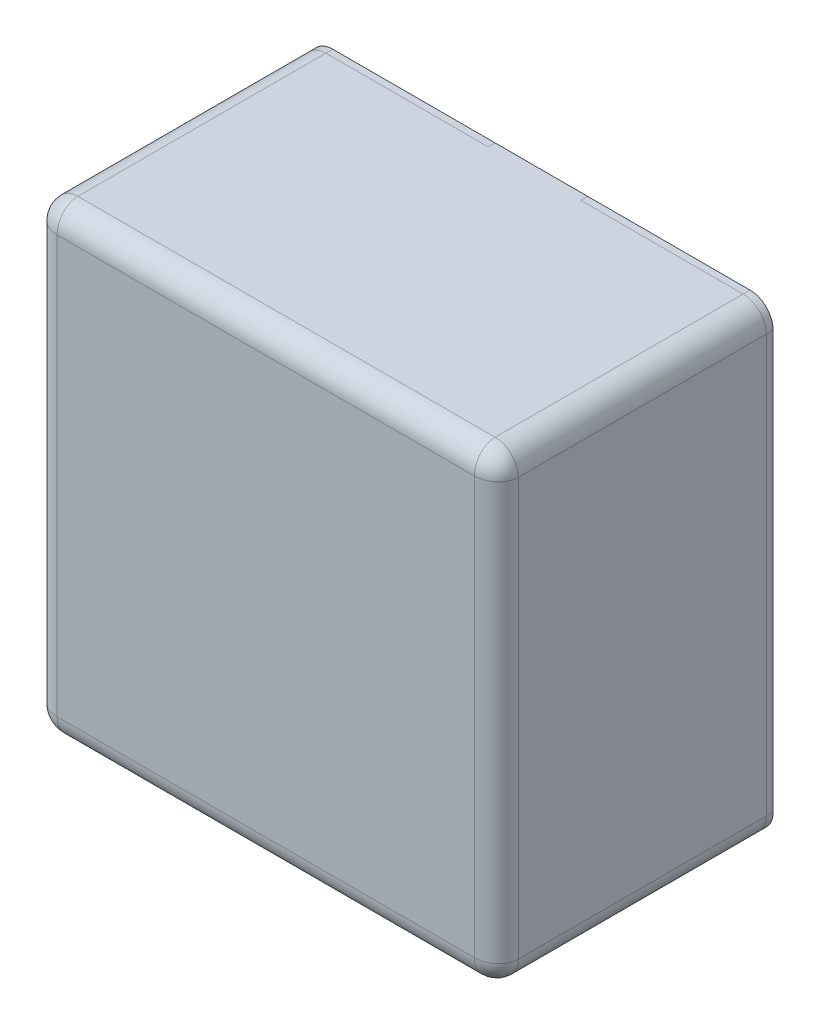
ISO-10303-21;
HEADER;
FILE_DESCRIPTION(('STEP AP214'),'2;1');
FILE_NAME('part.step','',(''),(''),'','','');
FILE_SCHEMA(('AUTOMOTIVE_DESIGN { 1 0 10303 214 1 1 1 1 }'));
ENDSEC;
DATA;
#1=APPLICATION_CONTEXT('core data for automotive mechanical design processes');
#2=APPLICATION_PROTOCOL_DEFINITION('international standard','automotive_design',2000,#1);
#3=PRODUCT_CONTEXT('',#1,'mechanical');
#4=PRODUCT('Part','Part','',(#3));
#5=PRODUCT_RELATED_PRODUCT_CATEGORY('part','',(#4));
#6=PRODUCT_DEFINITION_FORMATION('','',#4);
#7=PRODUCT_DEFINITION_CONTEXT('part definition',#1,'design');
#8=PRODUCT_DEFINITION('design','',#6,#7);
#9=PRODUCT_DEFINITION_SHAPE('','',#8);
#10=(LENGTH_UNIT() NAMED_UNIT(*) SI_UNIT(.MILLI.,.METRE.));
#11=(NAMED_UNIT(*) PLANE_ANGLE_UNIT() SI_UNIT($,.RADIAN.));
#12=(NAMED_UNIT(*) SI_UNIT($,.STERADIAN.) SOLID_ANGLE_UNIT());
#13=UNCERTAINTY_MEASURE_WITH_UNIT(LENGTH_MEASURE(1.E-05),#10,'distance_accuracy_value','');
#14=(GEOMETRIC_REPRESENTATION_CONTEXT(3) GLOBAL_UNCERTAINTY_ASSIGNED_CONTEXT((#13)) GLOBAL_UNIT_ASSIGNED_CONTEXT((#10,
#11,#12)) REPRESENTATION_CONTEXT('',''));
#15=CARTESIAN_POINT('',(0.,0.,0.));
#16=DIRECTION('',(0.,0.,1.));
#17=DIRECTION('',(1.,0.,0.));
#18=AXIS2_PLACEMENT_3D('',#15,#16,#17);
#19=CARTESIAN_POINT('',(3.03,2.96999999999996,2.04));
#20=DIRECTION('',(0.,0.,1.));
#21=DIRECTION('',(1.,0.,0.));
#22=AXIS2_PLACEMENT_3D('',#19,#20,#21);
#23=CYLINDRICAL_SURFACE('',#22,0.33);
#24=CARTESIAN_POINT('',(3.03,2.96999999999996,2.04));
#25=DIRECTION('',(0.,0.,1.));
#26=DIRECTION('',(0.,-1.,0.));
#27=AXIS2_PLACEMENT_3D('',#24,#25,#26);
#28=CIRCLE('',#27,0.33);
#29=CARTESIAN_POINT('',(3.36,2.96999999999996,2.04));
#30=VERTEX_POINT('',#29);
#31=CARTESIAN_POINT('',(3.03,3.29999999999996,2.04));
#32=VERTEX_POINT('',#31);
#33=EDGE_CURVE('E11',#30,#32,#28,.T.);
#34=ORIENTED_EDGE('',*,*,#33,.T.);
#35=DIRECTION('',(0.,0.,1.));
#36=VECTOR('',#35,1.);
#37=CARTESIAN_POINT('',(3.03,3.29999999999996,2.04));
#38=LINE('',#37,#36);
#39=CARTESIAN_POINT('',(3.03,3.29999999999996,2.13806148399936));
#40=VERTEX_POINT('',#39);
#41=EDGE_CURVE('E374',#32,#40,#38,.T.);
#42=ORIENTED_EDGE('',*,*,#41,.T.);
#43=CARTESIAN_POINT('',(3.03,2.96999999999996,2.13806148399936));
#44=DIRECTION('',(0.,0.,1.));
#45=DIRECTION('',(0.,-1.,0.));
#46=AXIS2_PLACEMENT_3D('',#43,#44,#45);
#47=CIRCLE('',#46,0.33);
#48=CARTESIAN_POINT('',(3.36,2.96999999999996,2.13806148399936));
#49=VERTEX_POINT('',#48);
#50=EDGE_CURVE('E367',#49,#40,#47,.T.);
#51=ORIENTED_EDGE('',*,*,#50,.F.);
#52=DIRECTION('',(0.,0.,1.));
#53=VECTOR('',#52,1.);
#54=CARTESIAN_POINT('',(3.36,2.96999999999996,2.04));
#55=LINE('',#54,#53);
#56=EDGE_CURVE('E275',#30,#49,#55,.T.);
#57=ORIENTED_EDGE('',*,*,#56,.F.);
#58=EDGE_LOOP('',(#34,#42,#51,#57));
#59=FACE_BOUND('',#58,.T.);
#60=ADVANCED_FACE('F17',(#59),#23,.T.);
#61=CARTESIAN_POINT('',(0.720000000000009,-3.30000000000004,2.04));
#62=DIRECTION('',(0.,0.,1.));
#63=DIRECTION('',(1.,0.,0.));
#64=AXIS2_PLACEMENT_3D('',#61,#62,#63);
#65=PLANE('',#64);
#66=DIRECTION('',(1.,0.,0.));
#67=VECTOR('',#66,1.);
#68=CARTESIAN_POINT('',(0.720000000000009,3.29999999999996,2.04));
#69=LINE('',#68,#67);
#70=CARTESIAN_POINT('',(0.720000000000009,3.29999999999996,2.04));
#71=VERTEX_POINT('',#70);
#72=EDGE_CURVE('E371',#71,#32,#69,.T.);
#73=ORIENTED_EDGE('',*,*,#72,.T.);
#74=ORIENTED_EDGE('',*,*,#33,.F.);
#75=DIRECTION('',(0.,1.,0.));
#76=VECTOR('',#75,1.);
#77=CARTESIAN_POINT('',(3.36,-3.30000000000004,2.04));
#78=LINE('',#77,#76);
#79=CARTESIAN_POINT('',(3.36,-2.97000000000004,2.04));
#80=VERTEX_POINT('',#79);
#81=EDGE_CURVE('E278',#80,#30,#78,.T.);
#82=ORIENTED_EDGE('',*,*,#81,.F.);
#83=CARTESIAN_POINT('',(3.03,-2.97000000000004,2.04));
#84=DIRECTION('',(0.,0.,-1.));
#85=DIRECTION('',(0.,-1.,0.));
#86=AXIS2_PLACEMENT_3D('',#83,#84,#85);
#87=CIRCLE('',#86,0.33);
#88=CARTESIAN_POINT('',(3.03,-3.30000000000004,2.04));
#89=VERTEX_POINT('',#88);
#90=EDGE_CURVE('E28',#80,#89,#87,.T.);
#91=ORIENTED_EDGE('',*,*,#90,.T.);
#92=DIRECTION('',(1.,0.,0.));
#93=VECTOR('',#92,1.);
#94=CARTESIAN_POINT('',(0.720000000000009,-3.30000000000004,2.04));
#95=LINE('',#94,#93);
#96=CARTESIAN_POINT('',(0.720000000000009,-3.30000000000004,2.04));
#97=VERTEX_POINT('',#96);
#98=EDGE_CURVE('E363',#97,#89,#95,.T.);
#99=ORIENTED_EDGE('',*,*,#98,.F.);
#100=DIRECTION('',(0.,1.,0.));
#101=VECTOR('',#100,1.);
#102=CARTESIAN_POINT('',(0.720000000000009,-3.30000000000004,2.04));
#103=LINE('',#102,#101);
#104=EDGE_CURVE('E302',#97,#71,#103,.T.);
#105=ORIENTED_EDGE('',*,*,#104,.T.);
#106=EDGE_LOOP('',(#73,#74,#82,#91,#99,#105));
#107=FACE_BOUND('',#106,.T.);
#108=ADVANCED_FACE('F382',(#107),#65,.F.);
#109=CARTESIAN_POINT('',(3.03,-2.97000000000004,2.04));
#110=DIRECTION('',(0.,0.,1.));
#111=DIRECTION('',(1.,0.,0.));
#112=AXIS2_PLACEMENT_3D('',#109,#110,#111);
#113=CYLINDRICAL_SURFACE('',#112,0.33);
#114=DIRECTION('',(0.,0.,1.));
#115=VECTOR('',#114,1.);
#116=CARTESIAN_POINT('',(3.36,-2.97000000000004,2.04));
#117=LINE('',#116,#115);
#118=CARTESIAN_POINT('',(3.36,-2.97000000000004,2.13806148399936));
#119=VERTEX_POINT('',#118);
#120=EDGE_CURVE('E377',#80,#119,#117,.T.);
#121=ORIENTED_EDGE('',*,*,#120,.T.);
#122=CARTESIAN_POINT('',(3.03,-2.97000000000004,2.13806148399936));
#123=DIRECTION('',(0.,0.,-1.));
#124=DIRECTION('',(0.,-1.,0.));
#125=AXIS2_PLACEMENT_3D('',#122,#123,#124);
#126=CIRCLE('',#125,0.33);
#127=CARTESIAN_POINT('',(3.03,-3.30000000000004,2.13806148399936));
#128=VERTEX_POINT('',#127);
#129=EDGE_CURVE('E286',#119,#128,#126,.T.);
#130=ORIENTED_EDGE('',*,*,#129,.T.);
#131=DIRECTION('',(0.,0.,1.));
#132=VECTOR('',#131,1.);
#133=CARTESIAN_POINT('',(3.03,-3.30000000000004,2.04));
#134=LINE('',#133,#132);
#135=EDGE_CURVE('E364',#89,#128,#134,.T.);
#136=ORIENTED_EDGE('',*,*,#135,.F.);
#137=ORIENTED_EDGE('',*,*,#90,.F.);
#138=EDGE_LOOP('',(#121,#130,#136,#137));
#139=FACE_BOUND('',#138,.T.);
#140=ADVANCED_FACE('F387',(#139),#113,.T.);
#141=CARTESIAN_POINT('',(3.36,-3.30000000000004,2.04));
#142=DIRECTION('',(1.,0.,0.));
#143=DIRECTION('',(0.,1.,0.));
#144=AXIS2_PLACEMENT_3D('',#141,#142,#143);
#145=PLANE('',#144);
#146=DIRECTION('',(0.,1.,0.));
#147=VECTOR('',#146,1.);
#148=CARTESIAN_POINT('',(3.36,-3.30000000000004,2.13806148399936));
#149=LINE('',#148,#147);
#150=EDGE_CURVE('E345',#119,#49,#149,.T.);
#151=ORIENTED_EDGE('',*,*,#150,.F.);
#152=ORIENTED_EDGE('',*,*,#120,.F.);
#153=ORIENTED_EDGE('',*,*,#81,.T.);
#154=ORIENTED_EDGE('',*,*,#56,.T.);
#155=EDGE_LOOP('',(#151,#152,#153,#154));
#156=FACE_BOUND('',#155,.T.);
#157=ADVANCED_FACE('F469',(#156),#145,.T.);
#158=CARTESIAN_POINT('',(0.720000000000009,3.29999999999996,2.04));
#159=DIRECTION('',(0.,1.,0.));
#160=DIRECTION('',(1.,0.,0.));
#161=AXIS2_PLACEMENT_3D('',#158,#159,#160);
#162=PLANE('',#161);
#163=ORIENTED_EDGE('',*,*,#72,.F.);
#164=DIRECTION('',(0.,0.,1.));
#165=VECTOR('',#164,1.);
#166=CARTESIAN_POINT('',(0.720000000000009,3.29999999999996,2.04));
#167=LINE('',#166,#165);
#168=CARTESIAN_POINT('',(0.720000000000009,3.29999999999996,2.13806148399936));
#169=VERTEX_POINT('',#168);
#170=EDGE_CURVE('E331',#71,#169,#167,.T.);
#171=ORIENTED_EDGE('',*,*,#170,.T.);
#172=DIRECTION('',(1.,0.,0.));
#173=VECTOR('',#172,1.);
#174=CARTESIAN_POINT('',(0.720000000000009,3.29999999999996,2.13806148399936));
#175=LINE('',#174,#173);
#176=EDGE_CURVE('E327',#169,#40,#175,.T.);
#177=ORIENTED_EDGE('',*,*,#176,.T.);
#178=ORIENTED_EDGE('',*,*,#41,.F.);
#179=EDGE_LOOP('',(#163,#171,#177,#178));
#180=FACE_BOUND('',#179,.T.);
#181=ADVANCED_FACE('F456',(#180),#162,.T.);
#182=CARTESIAN_POINT('',(3.03,2.96999999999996,2.04));
#183=DIRECTION('',(0.,0.,1.));
#184=DIRECTION('',(1.,0.,0.));
#185=AXIS2_PLACEMENT_3D('',#182,#183,#184);
#186=CYLINDRICAL_SURFACE('',#185,0.33);
#187=DIRECTION('',(0.,0.,1.));
#188=VECTOR('',#187,1.);
#189=CARTESIAN_POINT('',(3.36,2.96999999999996,2.04));
#190=LINE('',#189,#188);
#191=CARTESIAN_POINT('',(3.36,2.96999999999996,5.66827490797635));
#192=VERTEX_POINT('',#191);
#193=EDGE_CURVE('E349',#49,#192,#190,.T.);
#194=ORIENTED_EDGE('',*,*,#193,.F.);
#195=ORIENTED_EDGE('',*,*,#50,.T.);
#196=DIRECTION('',(0.,0.,1.));
#197=VECTOR('',#196,1.);
#198=CARTESIAN_POINT('',(3.03,3.29999999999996,2.04));
#199=LINE('',#198,#197);
#200=CARTESIAN_POINT('',(3.03,3.29999999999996,5.66827490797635));
#201=VERTEX_POINT('',#200);
#202=EDGE_CURVE('E323',#40,#201,#199,.T.);
#203=ORIENTED_EDGE('',*,*,#202,.T.);
#204=CARTESIAN_POINT('',(3.03,2.96999999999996,5.66827490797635));
#205=DIRECTION('',(0.,0.,-1.));
#206=DIRECTION('',(0.,1.,0.));
#207=AXIS2_PLACEMENT_3D('',#204,#205,#206);
#208=CIRCLE('',#207,0.33);
#209=EDGE_CURVE('E338',#201,#192,#208,.T.);
#210=ORIENTED_EDGE('',*,*,#209,.T.);
#211=EDGE_LOOP('',(#194,#195,#203,#210));
#212=FACE_BOUND('',#211,.T.);
#213=ADVANCED_FACE('F463',(#212),#186,.T.);
#214=CARTESIAN_POINT('',(-3.24,3.29999999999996,2.04));
#215=DIRECTION('',(0.,1.,0.));
#216=DIRECTION('',(1.,0.,0.));
#217=AXIS2_PLACEMENT_3D('',#214,#215,#216);
#218=PLANE('',#217);
#219=DIRECTION('',(1.,0.,0.));
#220=VECTOR('',#219,1.);
#221=CARTESIAN_POINT('',(-3.24,3.29999999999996,2.04));
#222=LINE('',#221,#220);
#223=CARTESIAN_POINT('',(-2.91,3.29999999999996,2.04));
#224=VERTEX_POINT('',#223);
#225=CARTESIAN_POINT('',(-0.599999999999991,3.29999999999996,2.04));
#226=VERTEX_POINT('',#225);
#227=EDGE_CURVE('E312',#224,#226,#222,.T.);
#228=ORIENTED_EDGE('',*,*,#227,.F.);
#229=DIRECTION('',(0.,0.,1.));
#230=VECTOR('',#229,1.);
#231=CARTESIAN_POINT('',(-2.91,3.29999999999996,2.04));
#232=LINE('',#231,#230);
#233=CARTESIAN_POINT('',(-2.91,3.29999999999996,2.13806148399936));
#234=VERTEX_POINT('',#233);
#235=EDGE_CURVE('E346',#224,#234,#232,.T.);
#236=ORIENTED_EDGE('',*,*,#235,.T.);
#237=DIRECTION('',(1.,0.,0.));
#238=VECTOR('',#237,1.);
#239=CARTESIAN_POINT('',(-3.24,3.29999999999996,2.13806148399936));
#240=LINE('',#239,#238);
#241=CARTESIAN_POINT('',(-0.599999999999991,3.29999999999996,2.13806148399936));
#242=VERTEX_POINT('',#241);
#243=EDGE_CURVE('E319',#234,#242,#240,.T.);
#244=ORIENTED_EDGE('',*,*,#243,.T.);
#245=DIRECTION('',(0.,0.,1.));
#246=VECTOR('',#245,1.);
#247=CARTESIAN_POINT('',(-0.599999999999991,3.29999999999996,2.04));
#248=LINE('',#247,#246);
#249=EDGE_CURVE('E335',#226,#242,#248,.T.);
#250=ORIENTED_EDGE('',*,*,#249,.F.);
#251=EDGE_LOOP('',(#228,#236,#244,#250));
#252=FACE_BOUND('',#251,.T.);
#253=ADVANCED_FACE('F662',(#252),#218,.T.);
#254=CARTESIAN_POINT('',(0.720000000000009,-3.30000000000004,2.04));
#255=DIRECTION('',(0.,1.,0.));
#256=DIRECTION('',(1.,0.,0.));
#257=AXIS2_PLACEMENT_3D('',#254,#255,#256);
#258=PLANE('',#257);
#259=ORIENTED_EDGE('',*,*,#98,.T.);
#260=ORIENTED_EDGE('',*,*,#135,.T.);
#261=DIRECTION('',(1.,0.,0.));
#262=VECTOR('',#261,1.);
#263=CARTESIAN_POINT('',(0.720000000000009,-3.30000000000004,2.13806148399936));
#264=LINE('',#263,#262);
#265=CARTESIAN_POINT('',(0.720000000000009,-3.30000000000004,2.13806148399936));
#266=VERTEX_POINT('',#265);
#267=EDGE_CURVE('E298',#266,#128,#264,.T.);
#268=ORIENTED_EDGE('',*,*,#267,.F.);
#269=DIRECTION('',(0.,0.,1.));
#270=VECTOR('',#269,1.);
#271=CARTESIAN_POINT('',(0.720000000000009,-3.30000000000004,2.04));
#272=LINE('',#271,#270);
#273=EDGE_CURVE('E294',#97,#266,#272,.T.);
#274=ORIENTED_EDGE('',*,*,#273,.F.);
#275=EDGE_LOOP('',(#259,#260,#268,#274));
#276=FACE_BOUND('',#275,.T.);
#277=ADVANCED_FACE('F392',(#276),#258,.F.);
#278=CARTESIAN_POINT('',(-3.24,-3.30000000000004,2.04));
#279=DIRECTION('',(0.,0.,1.));
#280=DIRECTION('',(1.,0.,0.));
#281=AXIS2_PLACEMENT_3D('',#278,#279,#280);
#282=PLANE('',#281);
#283=DIRECTION('',(0.,1.,0.));
#284=VECTOR('',#283,1.);
#285=CARTESIAN_POINT('',(-0.599999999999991,-3.30000000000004,2.04));
#286=LINE('',#285,#284);
#287=CARTESIAN_POINT('',(-0.599999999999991,-3.30000000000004,2.04));
#288=VERTEX_POINT('',#287);
#289=EDGE_CURVE('E287',#288,#226,#286,.T.);
#290=ORIENTED_EDGE('',*,*,#289,.T.);
#291=DIRECTION('',(1.,0.,0.));
#292=VECTOR('',#291,1.);
#293=CARTESIAN_POINT('',(-3.24,3.29999999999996,2.04));
#294=LINE('',#293,#292);
#295=EDGE_CURVE('E334',#226,#71,#294,.T.);
#296=ORIENTED_EDGE('',*,*,#295,.T.);
#297=ORIENTED_EDGE('',*,*,#104,.F.);
#298=DIRECTION('',(1.,0.,0.));
#299=VECTOR('',#298,1.);
#300=CARTESIAN_POINT('',(-3.24,-3.30000000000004,2.04));
#301=LINE('',#300,#299);
#302=EDGE_CURVE('E292',#288,#97,#301,.T.);
#303=ORIENTED_EDGE('',*,*,#302,.F.);
#304=EDGE_LOOP('',(#290,#296,#297,#303));
#305=FACE_BOUND('',#304,.T.);
#306=ADVANCED_FACE('F450',(#305),#282,.F.);
#307=CARTESIAN_POINT('',(-3.24,-3.30000000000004,2.04));
#308=DIRECTION('',(0.,1.,0.));
#309=DIRECTION('',(1.,0.,0.));
#310=AXIS2_PLACEMENT_3D('',#307,#308,#309);
#311=PLANE('',#310);
#312=DIRECTION('',(1.,0.,0.));
#313=VECTOR('',#312,1.);
#314=CARTESIAN_POINT('',(-3.24,-3.30000000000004,2.04));
#315=LINE('',#314,#313);
#316=CARTESIAN_POINT('',(-2.91,-3.30000000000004,2.04));
#317=VERTEX_POINT('',#316);
#318=EDGE_CURVE('E284',#317,#288,#315,.T.);
#319=ORIENTED_EDGE('',*,*,#318,.T.);
#320=DIRECTION('',(0.,0.,1.));
#321=VECTOR('',#320,1.);
#322=CARTESIAN_POINT('',(-0.599999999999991,-3.30000000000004,2.04));
#323=LINE('',#322,#321);
#324=CARTESIAN_POINT('',(-0.599999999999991,-3.30000000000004,2.13806148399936));
#325=VERTEX_POINT('',#324);
#326=EDGE_CURVE('E289',#288,#325,#323,.T.);
#327=ORIENTED_EDGE('',*,*,#326,.T.);
#328=DIRECTION('',(1.,0.,0.));
#329=VECTOR('',#328,1.);
#330=CARTESIAN_POINT('',(-3.24,-3.30000000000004,2.13806148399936));
#331=LINE('',#330,#329);
#332=CARTESIAN_POINT('',(-2.91,-3.30000000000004,2.13806148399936));
#333=VERTEX_POINT('',#332);
#334=EDGE_CURVE('E293',#333,#325,#331,.T.);
#335=ORIENTED_EDGE('',*,*,#334,.F.);
#336=DIRECTION('',(0.,0.,1.));
#337=VECTOR('',#336,1.);
#338=CARTESIAN_POINT('',(-2.91,-3.30000000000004,2.04));
#339=LINE('',#338,#337);
#340=EDGE_CURVE('E316',#317,#333,#339,.T.);
#341=ORIENTED_EDGE('',*,*,#340,.F.);
#342=EDGE_LOOP('',(#319,#327,#335,#341));
#343=FACE_BOUND('',#342,.T.);
#344=ADVANCED_FACE('F871',(#343),#311,.F.);
#345=CARTESIAN_POINT('',(3.03,-2.97000000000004,2.04));
#346=DIRECTION('',(0.,0.,1.));
#347=DIRECTION('',(1.,0.,0.));
#348=AXIS2_PLACEMENT_3D('',#345,#346,#347);
#349=CYLINDRICAL_SURFACE('',#348,0.33);
#350=CARTESIAN_POINT('',(3.03,-2.97000000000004,5.66827490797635));
#351=DIRECTION('',(0.,0.,-1.));
#352=DIRECTION('',(1.,0.,0.));
#353=AXIS2_PLACEMENT_3D('',#350,#351,#352);
#354=CIRCLE('',#353,0.33);
#355=CARTESIAN_POINT('',(3.36,-2.97000000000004,5.66827490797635));
#356=VERTEX_POINT('',#355);
#357=CARTESIAN_POINT('',(3.03,-3.30000000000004,5.66827490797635));
#358=VERTEX_POINT('',#357);
#359=EDGE_CURVE('E196',#356,#358,#354,.T.);
#360=ORIENTED_EDGE('',*,*,#359,.T.);
#361=DIRECTION('',(0.,0.,1.));
#362=VECTOR('',#361,1.);
#363=CARTESIAN_POINT('',(3.03,-3.30000000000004,2.04));
#364=LINE('',#363,#362);
#365=EDGE_CURVE('E306',#128,#358,#364,.T.);
#366=ORIENTED_EDGE('',*,*,#365,.F.);
#367=ORIENTED_EDGE('',*,*,#129,.F.);
#368=DIRECTION('',(0.,0.,1.));
#369=VECTOR('',#368,1.);
#370=CARTESIAN_POINT('',(3.36,-2.97000000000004,2.04));
#371=LINE('',#370,#369);
#372=EDGE_CURVE('E342',#119,#356,#371,.T.);
#373=ORIENTED_EDGE('',*,*,#372,.T.);
#374=EDGE_LOOP('',(#360,#366,#367,#373));
#375=FACE_BOUND('',#374,.T.);
#376=ADVANCED_FACE('F471',(#375),#349,.T.);
#377=CARTESIAN_POINT('',(-3.24,-3.30000000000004,2.04));
#378=DIRECTION('',(0.,0.,1.));
#379=DIRECTION('',(1.,0.,0.));
#380=AXIS2_PLACEMENT_3D('',#377,#378,#379);
#381=PLANE('',#380);
#382=DIRECTION('',(0.,1.,0.));
#383=VECTOR('',#382,1.);
#384=CARTESIAN_POINT('',(-3.24,-3.30000000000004,2.04));
#385=LINE('',#384,#383);
#386=CARTESIAN_POINT('',(-3.24,-2.97000000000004,2.04));
#387=VERTEX_POINT('',#386);
#388=CARTESIAN_POINT('',(-3.24,2.96999999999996,2.04));
#389=VERTEX_POINT('',#388);
#390=EDGE_CURVE('E208',#387,#389,#385,.T.);
#391=ORIENTED_EDGE('',*,*,#390,.T.);
#392=CARTESIAN_POINT('',(-2.91,2.96999999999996,2.04));
#393=DIRECTION('',(0.,0.,-1.));
#394=DIRECTION('',(0.,-1.,0.));
#395=AXIS2_PLACEMENT_3D('',#392,#393,#394);
#396=CIRCLE('',#395,0.33);
#397=EDGE_CURVE('E203',#389,#224,#396,.T.);
#398=ORIENTED_EDGE('',*,*,#397,.T.);
#399=ORIENTED_EDGE('',*,*,#227,.T.);
#400=ORIENTED_EDGE('',*,*,#289,.F.);
#401=ORIENTED_EDGE('',*,*,#318,.F.);
#402=CARTESIAN_POINT('',(-2.91,-2.97000000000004,2.04));
#403=DIRECTION('',(0.,0.,1.));
#404=DIRECTION('',(0.,-1.,0.));
#405=AXIS2_PLACEMENT_3D('',#402,#403,#404);
#406=CIRCLE('',#405,0.33);
#407=EDGE_CURVE('E309',#387,#317,#406,.T.);
#408=ORIENTED_EDGE('',*,*,#407,.F.);
#409=EDGE_LOOP('',(#391,#398,#399,#400,#401,#408));
#410=FACE_BOUND('',#409,.T.);
#411=ADVANCED_FACE('F851',(#410),#381,.F.);
#412=CARTESIAN_POINT('',(-2.91,2.96999999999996,2.04));
#413=DIRECTION('',(0.,0.,1.));
#414=DIRECTION('',(-1.,0.,0.));
#415=AXIS2_PLACEMENT_3D('',#412,#413,#414);
#416=CYLINDRICAL_SURFACE('',#415,0.33);
#417=DIRECTION('',(0.,0.,1.));
#418=VECTOR('',#417,1.);
#419=CARTESIAN_POINT('',(-3.24,2.96999999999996,2.04));
#420=LINE('',#419,#418);
#421=CARTESIAN_POINT('',(-3.24,2.96999999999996,2.13806148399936));
#422=VERTEX_POINT('',#421);
#423=EDGE_CURVE('E199',#389,#422,#420,.T.);
#424=ORIENTED_EDGE('',*,*,#423,.T.);
#425=CARTESIAN_POINT('',(-2.91,2.96999999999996,2.13806148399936));
#426=DIRECTION('',(0.,0.,-1.));
#427=DIRECTION('',(0.,-1.,0.));
#428=AXIS2_PLACEMENT_3D('',#425,#426,#427);
#429=CIRCLE('',#428,0.33);
#430=EDGE_CURVE('E185',#422,#234,#429,.T.);
#431=ORIENTED_EDGE('',*,*,#430,.T.);
#432=ORIENTED_EDGE('',*,*,#235,.F.);
#433=ORIENTED_EDGE('',*,*,#397,.F.);
#434=EDGE_LOOP('',(#424,#431,#432,#433));
#435=FACE_BOUND('',#434,.T.);
#436=ADVANCED_FACE('F201',(#435),#416,.T.);
#437=CARTESIAN_POINT('',(3.36,-3.30000000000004,2.04));
#438=DIRECTION('',(1.,0.,0.));
#439=DIRECTION('',(0.,1.,0.));
#440=AXIS2_PLACEMENT_3D('',#437,#438,#439);
#441=PLANE('',#440);
#442=ORIENTED_EDGE('',*,*,#372,.F.);
#443=ORIENTED_EDGE('',*,*,#150,.T.);
#444=ORIENTED_EDGE('',*,*,#193,.T.);
#445=DIRECTION('',(0.,-1.,0.));
#446=VECTOR('',#445,1.);
#447=CARTESIAN_POINT('',(3.36,2.96999999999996,5.66827490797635));
#448=LINE('',#447,#446);
#449=EDGE_CURVE('E269',#192,#356,#448,.T.);
#450=ORIENTED_EDGE('',*,*,#449,.T.);
#451=EDGE_LOOP('',(#442,#443,#444,#450));
#452=FACE_BOUND('',#451,.T.);
#453=ADVANCED_FACE('F467',(#452),#441,.T.);
#454=CARTESIAN_POINT('',(3.03,2.96999999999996,5.96245935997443));
#455=CARTESIAN_POINT('',(3.03000000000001,2.96999999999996,5.96245935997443));
#456=CARTESIAN_POINT('',(3.03,2.96999999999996,5.96245935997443));
#457=CARTESIAN_POINT('',(3.03000000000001,3.29999999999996,5.96245935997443));
#458=CARTESIAN_POINT('',(3.36,3.3,5.96245935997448));
#459=CARTESIAN_POINT('',(3.36000000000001,2.96999999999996,5.96245935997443));
#460=CARTESIAN_POINT('',(3.03,3.29999999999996,5.66827490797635));
#461=CARTESIAN_POINT('',(3.36000000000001,3.29999999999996,5.66827490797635));
#462=CARTESIAN_POINT('',(3.36,2.96999999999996,5.66827490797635));
#463=CARTESIAN_POINT('',(3.03000000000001,3.29999999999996,5.37409045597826));
#464=CARTESIAN_POINT('',(3.36,3.3,5.3740904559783));
#465=CARTESIAN_POINT('',(3.36000000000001,2.96999999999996,5.37409045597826));
#466=CARTESIAN_POINT('',(3.03,2.96999999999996,5.37409045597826));
#467=CARTESIAN_POINT('',(3.03000000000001,2.96999999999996,5.37409045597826));
#468=CARTESIAN_POINT('',(3.03,2.96999999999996,5.37409045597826));
#469=(BOUNDED_SURFACE() B_SPLINE_SURFACE(2,2,((#454,#455,#456),(#457,#458,#459),(#460,#461,
#462),(#463,#464,#465),(#466,#467,#468)),.UNSPECIFIED.,.F.,.F.,
.F.) B_SPLINE_SURFACE_WITH_KNOTS((3,2,3),(3,3),(-1.5707963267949,0.,1.5707963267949),
(3.14159265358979,4.71238898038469),
.UNSPECIFIED.) GEOMETRIC_REPRESENTATION_ITEM() RATIONAL_B_SPLINE_SURFACE(((1.,0.707106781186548,
1.),(0.707106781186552,0.5,0.707106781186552),(1.,0.707106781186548,1.),(0.707106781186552,0.5,
0.707106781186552),(1.,0.707106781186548,1.))) REPRESENTATION_ITEM('') SURFACE());
#470=CARTESIAN_POINT('',(3.03,2.96999999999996,5.66827490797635));
#471=DIRECTION('',(-1.,0.,0.));
#472=DIRECTION('',(0.,1.,0.));
#473=AXIS2_PLACEMENT_3D('',#470,#471,#472);
#474=ELLIPSE('',#473,0.33,0.294184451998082);
#475=CARTESIAN_POINT('',(3.03,2.96999999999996,5.96245935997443));
#476=VERTEX_POINT('',#475);
#477=EDGE_CURVE('E257',#476,#201,#474,.T.);
#478=CARTESIAN_POINT('',(3.03,2.96999999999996,5.66827490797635));
#479=DIRECTION('',(0.,1.,0.));
#480=DIRECTION('',(1.,0.,0.));
#481=AXIS2_PLACEMENT_3D('',#478,#479,#480);
#482=ELLIPSE('',#481,0.33,0.294184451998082);
#483=EDGE_CURVE('E209',#476,#192,#482,.T.);
#484=ORIENTED_EDGE('',*,*,#477,.F.);
#485=ORIENTED_EDGE('',*,*,#483,.T.);
#486=ORIENTED_EDGE('',*,*,#209,.F.);
#487=EDGE_LOOP('',(#484,#485,#486));
#488=FACE_BOUND('',#487,.T.);
#489=ADVANCED_FACE('F779',(#488),#469,.F.);
#490=CARTESIAN_POINT('',(-3.24,3.29999999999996,2.04));
#491=DIRECTION('',(0.,1.,0.));
#492=DIRECTION('',(1.,0.,0.));
#493=AXIS2_PLACEMENT_3D('',#490,#491,#492);
#494=PLANE('',#493);
#495=ORIENTED_EDGE('',*,*,#243,.F.);
#496=DIRECTION('',(0.,0.,1.));
#497=VECTOR('',#496,1.);
#498=CARTESIAN_POINT('',(-2.91,3.29999999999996,2.04));
#499=LINE('',#498,#497);
#500=CARTESIAN_POINT('',(-2.91,3.29999999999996,5.66827490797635));
#501=VERTEX_POINT('',#500);
#502=EDGE_CURVE('E192',#234,#501,#499,.T.);
#503=ORIENTED_EDGE('',*,*,#502,.T.);
#504=DIRECTION('',(1.,0.,0.));
#505=VECTOR('',#504,1.);
#506=CARTESIAN_POINT('',(-2.91,3.29999999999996,5.66827490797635));
#507=LINE('',#506,#505);
#508=EDGE_CURVE('E261',#501,#201,#507,.T.);
#509=ORIENTED_EDGE('',*,*,#508,.T.);
#510=ORIENTED_EDGE('',*,*,#202,.F.);
#511=ORIENTED_EDGE('',*,*,#176,.F.);
#512=ORIENTED_EDGE('',*,*,#170,.F.);
#513=ORIENTED_EDGE('',*,*,#295,.F.);
#514=ORIENTED_EDGE('',*,*,#249,.T.);
#515=EDGE_LOOP('',(#495,#503,#509,#510,#511,#512,#513,#514));
#516=FACE_BOUND('',#515,.T.);
#517=ADVANCED_FACE('F774',(#516),#494,.T.);
#518=CARTESIAN_POINT('',(-2.91,-2.97000000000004,2.04));
#519=DIRECTION('',(0.,0.,1.));
#520=DIRECTION('',(-1.,0.,0.));
#521=AXIS2_PLACEMENT_3D('',#518,#519,#520);
#522=CYLINDRICAL_SURFACE('',#521,0.33);
#523=ORIENTED_EDGE('',*,*,#407,.T.);
#524=ORIENTED_EDGE('',*,*,#340,.T.);
#525=CARTESIAN_POINT('',(-2.91,-2.97000000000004,2.13806148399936));
#526=DIRECTION('',(0.,0.,1.));
#527=DIRECTION('',(0.,-1.,0.));
#528=AXIS2_PLACEMENT_3D('',#525,#526,#527);
#529=CIRCLE('',#528,0.33);
#530=CARTESIAN_POINT('',(-3.24,-2.97000000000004,2.13806148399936));
#531=VERTEX_POINT('',#530);
#532=EDGE_CURVE('E250',#531,#333,#529,.T.);
#533=ORIENTED_EDGE('',*,*,#532,.F.);
#534=DIRECTION('',(0.,0.,1.));
#535=VECTOR('',#534,1.);
#536=CARTESIAN_POINT('',(-3.24,-2.97000000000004,2.04));
#537=LINE('',#536,#535);
#538=EDGE_CURVE('E215',#387,#531,#537,.T.);
#539=ORIENTED_EDGE('',*,*,#538,.F.);
#540=EDGE_LOOP('',(#523,#524,#533,#539));
#541=FACE_BOUND('',#540,.T.);
#542=ADVANCED_FACE('F778',(#541),#522,.T.);
#543=CARTESIAN_POINT('',(-3.24,-3.30000000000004,2.04));
#544=DIRECTION('',(0.,1.,0.));
#545=DIRECTION('',(1.,0.,0.));
#546=AXIS2_PLACEMENT_3D('',#543,#544,#545);
#547=PLANE('',#546);
#548=ORIENTED_EDGE('',*,*,#334,.T.);
#549=ORIENTED_EDGE('',*,*,#326,.F.);
#550=ORIENTED_EDGE('',*,*,#302,.T.);
#551=ORIENTED_EDGE('',*,*,#273,.T.);
#552=ORIENTED_EDGE('',*,*,#267,.T.);
#553=ORIENTED_EDGE('',*,*,#365,.T.);
#554=DIRECTION('',(-1.,0.,0.));
#555=VECTOR('',#554,1.);
#556=CARTESIAN_POINT('',(3.03,-3.30000000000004,5.66827490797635));
#557=LINE('',#556,#555);
#558=CARTESIAN_POINT('',(-2.91,-3.30000000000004,5.66827490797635));
#559=VERTEX_POINT('',#558);
#560=EDGE_CURVE('E242',#358,#559,#557,.T.);
#561=ORIENTED_EDGE('',*,*,#560,.T.);
#562=DIRECTION('',(0.,0.,1.));
#563=VECTOR('',#562,1.);
#564=CARTESIAN_POINT('',(-2.91,-3.30000000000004,2.04));
#565=LINE('',#564,#563);
#566=EDGE_CURVE('E254',#333,#559,#565,.T.);
#567=ORIENTED_EDGE('',*,*,#566,.F.);
#568=EDGE_LOOP('',(#548,#549,#550,#551,#552,#553,#561,#567));
#569=FACE_BOUND('',#568,.T.);
#570=ADVANCED_FACE('F448',(#569),#547,.F.);
#571=CARTESIAN_POINT('',(3.03,-2.97000000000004,5.96245935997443));
#572=CARTESIAN_POINT('',(3.03000000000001,-2.97000000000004,5.96245935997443));
#573=CARTESIAN_POINT('',(3.03,-2.97000000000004,5.96245935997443));
#574=CARTESIAN_POINT('',(3.36000000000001,-2.97000000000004,5.96245935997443));
#575=CARTESIAN_POINT('',(3.36,-3.30000000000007,5.96245935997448));
#576=CARTESIAN_POINT('',(3.03000000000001,-3.30000000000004,5.96245935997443));
#577=CARTESIAN_POINT('',(3.36,-2.97000000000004,5.66827490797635));
#578=CARTESIAN_POINT('',(3.36000000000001,-3.30000000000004,5.66827490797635));
#579=CARTESIAN_POINT('',(3.03,-3.30000000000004,5.66827490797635));
#580=CARTESIAN_POINT('',(3.36000000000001,-2.97000000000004,5.37409045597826));
#581=CARTESIAN_POINT('',(3.36,-3.30000000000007,5.3740904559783));
#582=CARTESIAN_POINT('',(3.03000000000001,-3.30000000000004,5.37409045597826));
#583=CARTESIAN_POINT('',(3.03,-2.97000000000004,5.37409045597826));
#584=CARTESIAN_POINT('',(3.03000000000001,-2.97000000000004,5.37409045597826));
#585=CARTESIAN_POINT('',(3.03,-2.97000000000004,5.37409045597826));
#586=(BOUNDED_SURFACE() B_SPLINE_SURFACE(2,2,((#571,#572,#573),(#574,#575,#576),(#577,#578,
#579),(#580,#581,#582),(#583,#584,#585)),.UNSPECIFIED.,.F.,.F.,
.F.) B_SPLINE_SURFACE_WITH_KNOTS((3,2,3),(3,3),(-1.5707963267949,0.,1.5707963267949),
(3.14159265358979,4.71238898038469),
.UNSPECIFIED.) GEOMETRIC_REPRESENTATION_ITEM() RATIONAL_B_SPLINE_SURFACE(((1.,0.707106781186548,
1.),(0.707106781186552,0.5,0.707106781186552),(1.,0.707106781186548,1.),(0.707106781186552,0.5,
0.707106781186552),(1.,0.707106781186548,1.))) REPRESENTATION_ITEM('') SURFACE());
#587=CARTESIAN_POINT('',(3.03,-2.97000000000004,5.66827490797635));
#588=DIRECTION('',(0.,1.,0.));
#589=DIRECTION('',(1.,0.,0.));
#590=AXIS2_PLACEMENT_3D('',#587,#588,#589);
#591=ELLIPSE('',#590,0.33,0.294184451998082);
#592=CARTESIAN_POINT('',(3.03,-2.97000000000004,5.96245935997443));
#593=VERTEX_POINT('',#592);
#594=EDGE_CURVE('E265',#593,#356,#591,.T.);
#595=CARTESIAN_POINT('',(3.03,-2.97000000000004,5.66827490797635));
#596=DIRECTION('',(1.,0.,0.));
#597=DIRECTION('',(0.,-1.,0.));
#598=AXIS2_PLACEMENT_3D('',#595,#596,#597);
#599=ELLIPSE('',#598,0.33,0.294184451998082);
#600=EDGE_CURVE('E245',#593,#358,#599,.T.);
#601=ORIENTED_EDGE('',*,*,#594,.F.);
#602=ORIENTED_EDGE('',*,*,#600,.T.);
#603=ORIENTED_EDGE('',*,*,#359,.F.);
#604=EDGE_LOOP('',(#601,#602,#603));
#605=FACE_BOUND('',#604,.T.);
#606=ADVANCED_FACE('F714',(#605),#586,.F.);
#607=CARTESIAN_POINT('',(-2.91,2.96999999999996,2.04));
#608=DIRECTION('',(0.,0.,1.));
#609=DIRECTION('',(-1.,0.,0.));
#610=AXIS2_PLACEMENT_3D('',#607,#608,#609);
#611=CYLINDRICAL_SURFACE('',#610,0.33);
#612=CARTESIAN_POINT('',(-2.91,2.96999999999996,5.66827490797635));
#613=DIRECTION('',(0.,0.,-1.));
#614=DIRECTION('',(-1.,0.,0.));
#615=AXIS2_PLACEMENT_3D('',#612,#613,#614);
#616=CIRCLE('',#615,0.33);
#617=CARTESIAN_POINT('',(-3.24,2.96999999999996,5.66827490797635));
#618=VERTEX_POINT('',#617);
#619=EDGE_CURVE('E239',#618,#501,#616,.T.);
#620=ORIENTED_EDGE('',*,*,#619,.T.);
#621=ORIENTED_EDGE('',*,*,#502,.F.);
#622=ORIENTED_EDGE('',*,*,#430,.F.);
#623=DIRECTION('',(0.,0.,1.));
#624=VECTOR('',#623,1.);
#625=CARTESIAN_POINT('',(-3.24,2.96999999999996,2.04));
#626=LINE('',#625,#624);
#627=EDGE_CURVE('E190',#422,#618,#626,.T.);
#628=ORIENTED_EDGE('',*,*,#627,.T.);
#629=EDGE_LOOP('',(#620,#621,#622,#628));
#630=FACE_BOUND('',#629,.T.);
#631=ADVANCED_FACE('F188',(#630),#611,.T.);
#632=CARTESIAN_POINT('',(-3.24,-3.30000000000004,2.04));
#633=DIRECTION('',(1.,0.,0.));
#634=DIRECTION('',(0.,1.,0.));
#635=AXIS2_PLACEMENT_3D('',#632,#633,#634);
#636=PLANE('',#635);
#637=DIRECTION('',(0.,1.,0.));
#638=VECTOR('',#637,1.);
#639=CARTESIAN_POINT('',(-3.24,-3.30000000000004,2.13806148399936));
#640=LINE('',#639,#638);
#641=EDGE_CURVE('E212',#531,#422,#640,.T.);
#642=ORIENTED_EDGE('',*,*,#641,.T.);
#643=ORIENTED_EDGE('',*,*,#423,.F.);
#644=ORIENTED_EDGE('',*,*,#390,.F.);
#645=ORIENTED_EDGE('',*,*,#538,.T.);
#646=EDGE_LOOP('',(#642,#643,#644,#645));
#647=FACE_BOUND('',#646,.T.);
#648=ADVANCED_FACE('F213',(#647),#636,.F.);
#649=CARTESIAN_POINT('',(3.03,-2.97000000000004,5.96245935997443));
#650=CARTESIAN_POINT('',(3.03,4.158,5.96245935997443));
#651=CARTESIAN_POINT('',(3.36000000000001,-2.97000000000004,5.96245935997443));
#652=CARTESIAN_POINT('',(3.36000000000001,4.15799999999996,5.96245935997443));
#653=CARTESIAN_POINT('',(3.36,-2.97000000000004,5.66827490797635));
#654=CARTESIAN_POINT('',(3.36,4.158,5.66827490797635));
#655=(BOUNDED_SURFACE() B_SPLINE_SURFACE(2,1,((#649,#650),(#651,#652),(#653,#654)),
.UNSPECIFIED.,.F.,.F.,.F.) B_SPLINE_SURFACE_WITH_KNOTS((3,3),(2,2),(-1.5707963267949,0.),(0.,
0.7128),.UNSPECIFIED.) GEOMETRIC_REPRESENTATION_ITEM() RATIONAL_B_SPLINE_SURFACE(((1.,1.),
(0.707106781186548,0.707106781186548),(1.,1.))) REPRESENTATION_ITEM('') SURFACE());
#656=DIRECTION('',(0.,-1.,0.));
#657=VECTOR('',#656,1.);
#658=CARTESIAN_POINT('',(3.03,2.96999999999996,5.96245935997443));
#659=LINE('',#658,#657);
#660=EDGE_CURVE('E233',#476,#593,#659,.T.);
#661=ORIENTED_EDGE('',*,*,#660,.T.);
#662=ORIENTED_EDGE('',*,*,#594,.T.);
#663=ORIENTED_EDGE('',*,*,#449,.F.);
#664=ORIENTED_EDGE('',*,*,#483,.F.);
#665=EDGE_LOOP('',(#661,#662,#663,#664));
#666=FACE_BOUND('',#665,.T.);
#667=ADVANCED_FACE('F725',(#666),#655,.T.);
#668=CARTESIAN_POINT('',(-2.91,3.29999999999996,5.66827490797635));
#669=CARTESIAN_POINT('',(4.218,3.29999999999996,5.66827490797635));
#670=CARTESIAN_POINT('',(-2.90999999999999,3.29999999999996,5.96245935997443));
#671=CARTESIAN_POINT('',(4.21800000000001,3.29999999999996,5.96245935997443));
#672=CARTESIAN_POINT('',(-2.91,2.96999999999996,5.96245935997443));
#673=CARTESIAN_POINT('',(4.218,2.96999999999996,5.96245935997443));
#674=(BOUNDED_SURFACE() B_SPLINE_SURFACE(2,1,((#668,#669),(#670,#671),(#672,#673)),
.UNSPECIFIED.,.F.,.F.,.F.) B_SPLINE_SURFACE_WITH_KNOTS((3,3),(2,2),(-3.14159265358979,
-1.5707963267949),(0.,0.7128),
.UNSPECIFIED.) GEOMETRIC_REPRESENTATION_ITEM() RATIONAL_B_SPLINE_SURFACE(((1.,1.),
(0.707106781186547,0.707106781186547),(1.,1.))) REPRESENTATION_ITEM('') SURFACE());
#675=DIRECTION('',(1.,0.,0.));
#676=VECTOR('',#675,1.);
#677=CARTESIAN_POINT('',(-2.91,2.96999999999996,5.96245935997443));
#678=LINE('',#677,#676);
#679=CARTESIAN_POINT('',(-2.91,2.96999999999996,5.96245935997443));
#680=VERTEX_POINT('',#679);
#681=EDGE_CURVE('E407',#680,#476,#678,.T.);
#682=CARTESIAN_POINT('',(-2.91,2.96999999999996,5.66827490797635));
#683=DIRECTION('',(-1.,0.,0.));
#684=DIRECTION('',(0.,1.,0.));
#685=AXIS2_PLACEMENT_3D('',#682,#683,#684);
#686=ELLIPSE('',#685,0.33,0.294184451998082);
#687=EDGE_CURVE('E220',#680,#501,#686,.T.);
#688=ORIENTED_EDGE('',*,*,#681,.T.);
#689=ORIENTED_EDGE('',*,*,#477,.T.);
#690=ORIENTED_EDGE('',*,*,#508,.F.);
#691=ORIENTED_EDGE('',*,*,#687,.F.);
#692=EDGE_LOOP('',(#688,#689,#690,#691));
#693=FACE_BOUND('',#692,.T.);
#694=ADVANCED_FACE('F720',(#693),#674,.T.);
#695=CARTESIAN_POINT('',(-2.91,-2.97000000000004,2.04));
#696=DIRECTION('',(0.,0.,1.));
#697=DIRECTION('',(-1.,0.,0.));
#698=AXIS2_PLACEMENT_3D('',#695,#696,#697);
#699=CYLINDRICAL_SURFACE('',#698,0.33);
#700=DIRECTION('',(0.,0.,1.));
#701=VECTOR('',#700,1.);
#702=CARTESIAN_POINT('',(-3.24,-2.97000000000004,2.04));
#703=LINE('',#702,#701);
#704=CARTESIAN_POINT('',(-3.24,-2.97000000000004,5.66827490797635));
#705=VERTEX_POINT('',#704);
#706=EDGE_CURVE('E227',#531,#705,#703,.T.);
#707=ORIENTED_EDGE('',*,*,#706,.F.);
#708=ORIENTED_EDGE('',*,*,#532,.T.);
#709=ORIENTED_EDGE('',*,*,#566,.T.);
#710=CARTESIAN_POINT('',(-2.91,-2.97000000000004,5.66827490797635));
#711=DIRECTION('',(0.,0.,-1.));
#712=DIRECTION('',(0.,-1.,0.));
#713=AXIS2_PLACEMENT_3D('',#710,#711,#712);
#714=CIRCLE('',#713,0.33);
#715=EDGE_CURVE('E403',#559,#705,#714,.T.);
#716=ORIENTED_EDGE('',*,*,#715,.T.);
#717=EDGE_LOOP('',(#707,#708,#709,#716));
#718=FACE_BOUND('',#717,.T.);
#719=ADVANCED_FACE('F724',(#718),#699,.T.);
#720=CARTESIAN_POINT('',(-2.91,-2.97000000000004,5.96245935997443));
#721=CARTESIAN_POINT('',(4.218,-2.97000000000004,5.96245935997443));
#722=CARTESIAN_POINT('',(-2.90999999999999,-3.30000000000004,5.96245935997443));
#723=CARTESIAN_POINT('',(4.21800000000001,-3.30000000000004,5.96245935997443));
#724=CARTESIAN_POINT('',(-2.91,-3.30000000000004,5.66827490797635));
#725=CARTESIAN_POINT('',(4.218,-3.30000000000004,5.66827490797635));
#726=(BOUNDED_SURFACE() B_SPLINE_SURFACE(2,1,((#720,#721),(#722,#723),(#724,#725)),
.UNSPECIFIED.,.F.,.F.,.F.) B_SPLINE_SURFACE_WITH_KNOTS((3,3),(2,2),(-1.5707963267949,0.),(0.,
0.7128),.UNSPECIFIED.) GEOMETRIC_REPRESENTATION_ITEM() RATIONAL_B_SPLINE_SURFACE(((1.,1.),
(0.707106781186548,0.707106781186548),(1.,1.))) REPRESENTATION_ITEM('') SURFACE());
#727=DIRECTION('',(-1.,0.,0.));
#728=VECTOR('',#727,1.);
#729=CARTESIAN_POINT('',(3.03,-2.97000000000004,5.96245935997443));
#730=LINE('',#729,#728);
#731=CARTESIAN_POINT('',(-2.91,-2.97000000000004,5.96245935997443));
#732=VERTEX_POINT('',#731);
#733=EDGE_CURVE('E237',#593,#732,#730,.T.);
#734=CARTESIAN_POINT('',(-2.91,-2.97000000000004,5.66827490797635));
#735=DIRECTION('',(1.,0.,0.));
#736=DIRECTION('',(0.,-1.,0.));
#737=AXIS2_PLACEMENT_3D('',#734,#735,#736);
#738=ELLIPSE('',#737,0.33,0.294184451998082);
#739=EDGE_CURVE('E408',#732,#559,#738,.T.);
#740=ORIENTED_EDGE('',*,*,#733,.T.);
#741=ORIENTED_EDGE('',*,*,#739,.T.);
#742=ORIENTED_EDGE('',*,*,#560,.F.);
#743=ORIENTED_EDGE('',*,*,#600,.F.);
#744=EDGE_LOOP('',(#740,#741,#742,#743));
#745=FACE_BOUND('',#744,.T.);
#746=ADVANCED_FACE('F482',(#745),#726,.T.);
#747=CARTESIAN_POINT('',(-2.91,2.96999999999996,5.96245935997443));
#748=CARTESIAN_POINT('',(-2.90999999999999,2.96999999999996,5.96245935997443));
#749=CARTESIAN_POINT('',(-2.91,2.96999999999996,5.96245935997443));
#750=CARTESIAN_POINT('',(-3.23999999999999,2.96999999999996,5.96245935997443));
#751=CARTESIAN_POINT('',(-3.24,3.3,5.96245935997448));
#752=CARTESIAN_POINT('',(-2.90999999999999,3.29999999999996,5.96245935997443));
#753=CARTESIAN_POINT('',(-3.24,2.96999999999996,5.66827490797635));
#754=CARTESIAN_POINT('',(-3.23999999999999,3.29999999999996,5.66827490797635));
#755=CARTESIAN_POINT('',(-2.91,3.29999999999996,5.66827490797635));
#756=CARTESIAN_POINT('',(-3.23999999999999,2.96999999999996,5.37409045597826));
#757=CARTESIAN_POINT('',(-3.24,3.3,5.3740904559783));
#758=CARTESIAN_POINT('',(-2.90999999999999,3.29999999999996,5.37409045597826));
#759=CARTESIAN_POINT('',(-2.91,2.96999999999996,5.37409045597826));
#760=CARTESIAN_POINT('',(-2.90999999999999,2.96999999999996,5.37409045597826));
#761=CARTESIAN_POINT('',(-2.91,2.96999999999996,5.37409045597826));
#762=(BOUNDED_SURFACE() B_SPLINE_SURFACE(2,2,((#747,#748,#749),(#750,#751,#752),(#753,#754,
#755),(#756,#757,#758),(#759,#760,#761)),.UNSPECIFIED.,.F.,.F.,
.F.) B_SPLINE_SURFACE_WITH_KNOTS((3,2,3),(3,3),(-1.5707963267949,0.,1.5707963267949),
(3.14159265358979,4.71238898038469),
.UNSPECIFIED.) GEOMETRIC_REPRESENTATION_ITEM() RATIONAL_B_SPLINE_SURFACE(((1.,0.707106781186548,
1.),(0.707106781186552,0.5,0.707106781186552),(1.,0.707106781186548,1.),(0.707106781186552,0.5,
0.707106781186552),(1.,0.707106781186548,1.))) REPRESENTATION_ITEM('') SURFACE());
#763=CARTESIAN_POINT('',(-2.91,2.96999999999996,5.66827490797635));
#764=DIRECTION('',(0.,-1.,0.));
#765=DIRECTION('',(-1.,0.,0.));
#766=AXIS2_PLACEMENT_3D('',#763,#764,#765);
#767=ELLIPSE('',#766,0.33,0.294184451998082);
#768=EDGE_CURVE('E430',#680,#618,#767,.T.);
#769=ORIENTED_EDGE('',*,*,#768,.F.);
#770=ORIENTED_EDGE('',*,*,#687,.T.);
#771=ORIENTED_EDGE('',*,*,#619,.F.);
#772=EDGE_LOOP('',(#769,#770,#771));
#773=FACE_BOUND('',#772,.T.);
#774=ADVANCED_FACE('F744',(#773),#762,.F.);
#775=CARTESIAN_POINT('',(-3.24,-3.30000000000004,2.04));
#776=DIRECTION('',(1.,0.,0.));
#777=DIRECTION('',(0.,1.,0.));
#778=AXIS2_PLACEMENT_3D('',#775,#776,#777);
#779=PLANE('',#778);
#780=ORIENTED_EDGE('',*,*,#706,.T.);
#781=DIRECTION('',(0.,1.,0.));
#782=VECTOR('',#781,1.);
#783=CARTESIAN_POINT('',(-3.24,-2.97000000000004,5.66827490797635));
#784=LINE('',#783,#782);
#785=EDGE_CURVE('E224',#705,#618,#784,.T.);
#786=ORIENTED_EDGE('',*,*,#785,.T.);
#787=ORIENTED_EDGE('',*,*,#627,.F.);
#788=ORIENTED_EDGE('',*,*,#641,.F.);
#789=EDGE_LOOP('',(#780,#786,#787,#788));
#790=FACE_BOUND('',#789,.T.);
#791=ADVANCED_FACE('F222',(#790),#779,.F.);
#792=CARTESIAN_POINT('',(-3.24,-3.30000000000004,5.96245935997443));
#793=DIRECTION('',(0.,0.,1.));
#794=DIRECTION('',(1.,0.,0.));
#795=AXIS2_PLACEMENT_3D('',#792,#793,#794);
#796=PLANE('',#795);
#797=ORIENTED_EDGE('',*,*,#681,.F.);
#798=DIRECTION('',(0.,1.,0.));
#799=VECTOR('',#798,1.);
#800=CARTESIAN_POINT('',(-2.91,-2.97000000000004,5.96245935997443));
#801=LINE('',#800,#799);
#802=EDGE_CURVE('E437',#732,#680,#801,.T.);
#803=ORIENTED_EDGE('',*,*,#802,.F.);
#804=ORIENTED_EDGE('',*,*,#733,.F.);
#805=ORIENTED_EDGE('',*,*,#660,.F.);
#806=EDGE_LOOP('',(#797,#803,#804,#805));
#807=FACE_BOUND('',#806,.T.);
#808=ADVANCED_FACE('F680',(#807),#796,.T.);
#809=CARTESIAN_POINT('',(-2.91,-2.97000000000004,5.96245935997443));
#810=CARTESIAN_POINT('',(-2.90999999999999,-2.97000000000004,5.96245935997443));
#811=CARTESIAN_POINT('',(-2.91,-2.97000000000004,5.96245935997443));
#812=CARTESIAN_POINT('',(-2.90999999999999,-3.30000000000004,5.96245935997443));
#813=CARTESIAN_POINT('',(-3.24,-3.30000000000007,5.96245935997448));
#814=CARTESIAN_POINT('',(-3.23999999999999,-2.97000000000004,5.96245935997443));
#815=CARTESIAN_POINT('',(-2.91,-3.30000000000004,5.66827490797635));
#816=CARTESIAN_POINT('',(-3.23999999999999,-3.30000000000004,5.66827490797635));
#817=CARTESIAN_POINT('',(-3.24,-2.97000000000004,5.66827490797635));
#818=CARTESIAN_POINT('',(-2.90999999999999,-3.30000000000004,5.37409045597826));
#819=CARTESIAN_POINT('',(-3.24,-3.30000000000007,5.3740904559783));
#820=CARTESIAN_POINT('',(-3.23999999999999,-2.97000000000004,5.37409045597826));
#821=CARTESIAN_POINT('',(-2.91,-2.97000000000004,5.37409045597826));
#822=CARTESIAN_POINT('',(-2.90999999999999,-2.97000000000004,5.37409045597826));
#823=CARTESIAN_POINT('',(-2.91,-2.97000000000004,5.37409045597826));
#824=(BOUNDED_SURFACE() B_SPLINE_SURFACE(2,2,((#809,#810,#811),(#812,#813,#814),(#815,#816,
#817),(#818,#819,#820),(#821,#822,#823)),.UNSPECIFIED.,.F.,.F.,
.F.) B_SPLINE_SURFACE_WITH_KNOTS((3,2,3),(3,3),(-1.5707963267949,0.,1.5707963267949),
(3.14159265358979,4.71238898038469),
.UNSPECIFIED.) GEOMETRIC_REPRESENTATION_ITEM() RATIONAL_B_SPLINE_SURFACE(((1.,0.707106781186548,
1.),(0.707106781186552,0.5,0.707106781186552),(1.,0.707106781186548,1.),(0.707106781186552,0.5,
0.707106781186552),(1.,0.707106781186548,1.))) REPRESENTATION_ITEM('') SURFACE());
#825=CARTESIAN_POINT('',(-2.91,-2.97000000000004,5.66827490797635));
#826=DIRECTION('',(0.,-1.,0.));
#827=DIRECTION('',(-1.,0.,0.));
#828=AXIS2_PLACEMENT_3D('',#825,#826,#827);
#829=ELLIPSE('',#828,0.33,0.294184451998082);
#830=EDGE_CURVE('E418',#732,#705,#829,.T.);
#831=ORIENTED_EDGE('',*,*,#739,.F.);
#832=ORIENTED_EDGE('',*,*,#830,.T.);
#833=ORIENTED_EDGE('',*,*,#715,.F.);
#834=EDGE_LOOP('',(#831,#832,#833));
#835=FACE_BOUND('',#834,.T.);
#836=ADVANCED_FACE('F19',(#835),#824,.F.);
#837=CARTESIAN_POINT('',(-3.24,-2.97000000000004,5.66827490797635));
#838=CARTESIAN_POINT('',(-3.24,4.158,5.66827490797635));
#839=CARTESIAN_POINT('',(-3.23999999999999,-2.97000000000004,5.96245935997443));
#840=CARTESIAN_POINT('',(-3.23999999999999,4.15799999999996,5.96245935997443));
#841=CARTESIAN_POINT('',(-2.91,-2.97000000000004,5.96245935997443));
#842=CARTESIAN_POINT('',(-2.91,4.158,5.96245935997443));
#843=(BOUNDED_SURFACE() B_SPLINE_SURFACE(2,1,((#837,#838),(#839,#840),(#841,#842)),
.UNSPECIFIED.,.F.,.F.,.F.) B_SPLINE_SURFACE_WITH_KNOTS((3,3),(2,2),(-3.14159265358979,
-1.5707963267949),(0.,0.7128),
.UNSPECIFIED.) GEOMETRIC_REPRESENTATION_ITEM() RATIONAL_B_SPLINE_SURFACE(((1.,1.),
(0.707106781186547,0.707106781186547),(1.,1.))) REPRESENTATION_ITEM('') SURFACE());
#844=ORIENTED_EDGE('',*,*,#802,.T.);
#845=ORIENTED_EDGE('',*,*,#768,.T.);
#846=ORIENTED_EDGE('',*,*,#785,.F.);
#847=ORIENTED_EDGE('',*,*,#830,.F.);
#848=EDGE_LOOP('',(#844,#845,#846,#847));
#849=FACE_BOUND('',#848,.T.);
#850=ADVANCED_FACE('F679',(#849),#843,.T.);
#851=CLOSED_SHELL('',(#60,#108,#140,#157,#181,#213,#253,#277,#306,#344,#376,#411,#436,#453,#489,
#517,#542,#570,#606,#631,#648,#667,#694,#719,#746,#774,#791,#808,#836,#850));
#852=MANIFOLD_SOLID_BREP('B1',#851);
#853=ADVANCED_BREP_SHAPE_REPRESENTATION('',(#18,#852),#14);
#854=SHAPE_DEFINITION_REPRESENTATION(#9,#853);
ENDSEC;
END-ISO-10303-21;
